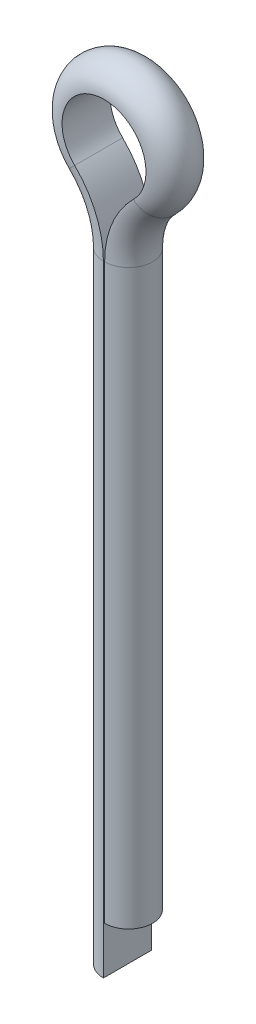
from build123d import *


with BuildPart() as part:
    # Pin: sweep along a path in Sketch1
    with BuildLine(Plane.XY) as pin_path:
        Line((0.025, -28), (0.025, -4.106321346))
        ThreePointArc((0.025, -4.106321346), (0.337182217, -2.557128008), (1.225, -1.249749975))
        ThreePointArc((1.225, -1.249749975), (0, 1.75), (-1.225, -1.249749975))
        ThreePointArc((-1.225, -1.249749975), (-0.337182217, -2.557128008), (-0.025, -4.106321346))
        Line((-0.025, -4.106321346), (-0.025, -30))
    # Sketch2 → Pin (sweep)
    with BuildSketch(Plane(origin=(0.025, -28, 0), x_dir=(1, 0, 0), z_dir=(0, -1, 0))):
        with BuildLine():
            Line((0, 1), (0, -1))
            ThreePointArc((0, -1), (1, 0), (0, 1))
        make_face()
    sweep(path=pin_path.line)


solid = part.part
